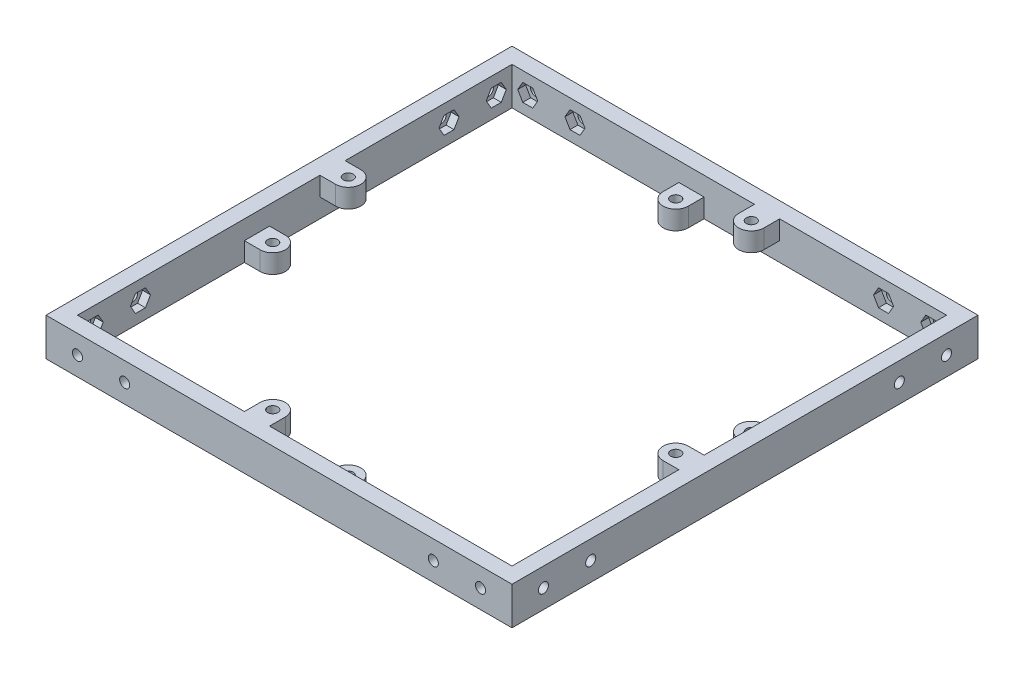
from build123d import *

# Parameters (mm, degrees)
SKETCH1_W           = 148
SKETCH1_H           = 148
SKETCH1_R           = 1.6
BOSS_EXTRUDE1_DEPTH = 6
SKETCH1_3_W         = 148
SKETCH1_3_H         = 148
SKETCH1_3_R         = 1.6
BOSS_EXTRUDE2_DEPTH = 6
CUT_EXTRUDE1_REACH  = 167.578
SKETCH2_R           = 1.6
CUT_EXTRUDE2_START  = -2.5
SKETCH2_3_R         = 1.6
CUT_EXTRUDE2_DEPTH  = 2.5
CIRPATTERN4_COUNT   = 4
CIRPATTERN6_COUNT   = 4


with BuildPart() as part:
    # Sketch1 → Boss-Extrude1 (new body)
    # profile 1 of 5: a face of its own
    with BuildSketch(Plane(origin=(0, 0, 0), x_dir=(1, 0, 0), z_dir=(0, 1, 0))):
        Rectangle(SKETCH1_W, SKETCH1_H)
        Polygon((16, -69), (69, -69), (69, -16), (69, -8), (69, 8), (69, 16), (69, 69), (16, 69), (8, 69), (-8, 69), (-16, 69), (-69, 69), (-69, 16), (-69, 8), (-69, -8), (-69, -16), (-69, -69), (-16, -69), (-8, -69), (8, -69), align=None, mode=Mode.SUBTRACT)
    # profile 2 of 5: a face of its own
    with BuildSketch(Plane(origin=(0, 0, 0), x_dir=(1, 0, 0), z_dir=(0, 1, 0))):
        with BuildLine():
            ThreePointArc((64, -16), (60, -12), (64, -8))
            Line((64, -8), (69, -8))
            Line((69, -8), (69, -16))
            Line((69, -16), (64, -16))
        make_face()
        with Locations(Location((64, -12, 0), (0, 0, 270))):
            Circle(SKETCH1_R, mode=Mode.SUBTRACT)
    # profile 3 of 5: a face of its own
    with BuildSketch(Plane(origin=(0, 0, 0), x_dir=(1, 0, 0), z_dir=(0, 1, 0))):
        with BuildLine():
            ThreePointArc((-16, -64), (-12, -60), (-8, -64))
            Line((-8, -64), (-8, -69))
            Line((-8, -69), (-16, -69))
            Line((-16, -69), (-16, -64))
        make_face()
        with Locations(Location((-12, -64, 0), (0, 0, 270))):
            Circle(SKETCH1_R, mode=Mode.SUBTRACT)
    # profile 4 of 5: a face of its own
    with BuildSketch(Plane(origin=(0, 0, 0), x_dir=(1, 0, 0), z_dir=(0, 1, 0))):
        with BuildLine():
            ThreePointArc((-64, 16), (-60, 12), (-64, 8))
            Line((-64, 8), (-69, 8))
            Line((-69, 8), (-69, 16))
            Line((-69, 16), (-64, 16))
        make_face()
        with Locations(Location((-64, 12, 0), (0, 0, 270))):
            Circle(SKETCH1_R, mode=Mode.SUBTRACT)
    # profile 5 of 5: a face of its own
    with BuildSketch(Plane(origin=(0, 0, 0), x_dir=(1, 0, 0), z_dir=(0, 1, 0))):
        with BuildLine():
            ThreePointArc((16, 64), (12, 60), (8, 64))
            Line((8, 64), (8, 69))
            Line((8, 69), (16, 69))
            Line((16, 69), (16, 64))
        make_face()
        with Locations(Location((12, 64, 0), (0, 0, 270))):
            Circle(SKETCH1_R, mode=Mode.SUBTRACT)
    extrude(amount=BOSS_EXTRUDE1_DEPTH)

    # Sketch1_3 → Boss-Extrude2 (add)
    # profile 1 of 5: a face of its own
    with BuildSketch(Plane(origin=(0, 0, 0), x_dir=(1, 0, 0), z_dir=(0, 1, 0))):
        Rectangle(SKETCH1_3_W, SKETCH1_3_H)
        Polygon((16, -69), (69, -69), (69, -16), (69, -8), (69, 8), (69, 16), (69, 69), (16, 69), (8, 69), (-8, 69), (-16, 69), (-69, 69), (-69, 16), (-69, 8), (-69, -8), (-69, -16), (-69, -69), (-16, -69), (-8, -69), (8, -69), align=None, mode=Mode.SUBTRACT)
    # profile 2 of 5: a face of its own
    with BuildSketch(Plane(origin=(0, 0, 0), x_dir=(1, 0, 0), z_dir=(0, 1, 0))):
        with BuildLine():
            ThreePointArc((8, -64), (12, -60), (16, -64))
            Line((16, -64), (16, -69))
            Line((16, -69), (8, -69))
            Line((8, -69), (8, -64))
        make_face()
        with Locations(Location((12, -64, 0), (0, 0, 270))):
            Circle(SKETCH1_3_R, mode=Mode.SUBTRACT)
    # profile 3 of 5: a face of its own
    with BuildSketch(Plane(origin=(0, 0, 0), x_dir=(1, 0, 0), z_dir=(0, 1, 0))):
        with BuildLine():
            ThreePointArc((-64, -8), (-60, -12), (-64, -16))
            Line((-64, -16), (-69, -16))
            Line((-69, -16), (-69, -8))
            Line((-69, -8), (-64, -8))
        make_face()
        with Locations(Location((-64, -12, 0), (0, 0, 270))):
            Circle(SKETCH1_3_R, mode=Mode.SUBTRACT)
    # profile 4 of 5: a face of its own
    with BuildSketch(Plane(origin=(0, 0, 0), x_dir=(1, 0, 0), z_dir=(0, 1, 0))):
        with BuildLine():
            ThreePointArc((-8, 64), (-12, 60), (-16, 64))
            Line((-16, 64), (-16, 69))
            Line((-16, 69), (-8, 69))
            Line((-8, 69), (-8, 64))
        make_face()
        with Locations(Location((-12, 64, 0), (0, 0, 270))):
            Circle(SKETCH1_3_R, mode=Mode.SUBTRACT)
    # profile 5 of 5: a face of its own
    with BuildSketch(Plane(origin=(0, 0, 0), x_dir=(1, 0, 0), z_dir=(0, 1, 0))):
        with BuildLine():
            ThreePointArc((64, 8), (60, 12), (64, 16))
            Line((64, 16), (69, 16))
            Line((69, 16), (69, 8))
            Line((69, 8), (64, 8))
        make_face()
        with Locations(Location((64, 12, 0), (0, 0, 270))):
            Circle(SKETCH1_3_R, mode=Mode.SUBTRACT)
    extrude(amount=-BOSS_EXTRUDE2_DEPTH)

    # Sketch2 → Cut-Extrude1 (cut, up to next)
    with BuildSketch(Plane(origin=(74, 0, 0), x_dir=(0, 0, -1), z_dir=(1, 0, 0)), mode=Mode.PRIVATE) as cut_extrude1_sk1:
        with Locations((-64, 0)):
            Circle(SKETCH2_R)
    cut_extrude1_tool1 = extrude(cut_extrude1_sk1.sketch, amount=-CUT_EXTRUDE1_REACH, mode=Mode.PRIVATE) & part.part
    # Sketch2 → Cut-Extrude1 (cut, up to next)
    with BuildSketch(Plane(origin=(74, 0, 0), x_dir=(0, 0, -1), z_dir=(1, 0, 0)), mode=Mode.PRIVATE) as cut_extrude1_sk2:
        with Locations((-49, 0)):
            Circle(SKETCH2_R)
    cut_extrude1_tool2 = extrude(cut_extrude1_sk2.sketch, amount=-CUT_EXTRUDE1_REACH, mode=Mode.PRIVATE) & part.part
    # Sketch2 → Cut-Extrude1 (cut, up to next)
    with BuildSketch(Plane(origin=(74, 0, 0), x_dir=(0, 0, -1), z_dir=(1, 0, 0)), mode=Mode.PRIVATE) as cut_extrude1_sk3:
        with Locations((49, 0)):
            Circle(SKETCH2_R)
    cut_extrude1_tool3 = extrude(cut_extrude1_sk3.sketch, amount=-CUT_EXTRUDE1_REACH, mode=Mode.PRIVATE) & part.part
    # Sketch2 → Cut-Extrude1 (cut, up to next)
    with BuildSketch(Plane(origin=(74, 0, 0), x_dir=(0, 0, -1), z_dir=(1, 0, 0)), mode=Mode.PRIVATE) as cut_extrude1_sk4:
        with Locations((64, 0)):
            Circle(SKETCH2_R)
    cut_extrude1_tool4 = extrude(cut_extrude1_sk4.sketch, amount=-CUT_EXTRUDE1_REACH, mode=Mode.PRIVATE) & part.part
    cut_extrude1_1 = cut_extrude1_tool1.solids().sort_by_distance((74, 0, 64))[0]
    add(cut_extrude1_1, mode=Mode.SUBTRACT)
    cut_extrude1_2 = cut_extrude1_tool2.solids().sort_by_distance((74, 0, 49))[0]
    add(cut_extrude1_2, mode=Mode.SUBTRACT)
    cut_extrude1_3 = cut_extrude1_tool3.solids().sort_by_distance((74, 0, -49))[0]
    add(cut_extrude1_3, mode=Mode.SUBTRACT)
    cut_extrude1_4 = cut_extrude1_tool4.solids().sort_by_distance((74, 0, -64))[0]
    add(cut_extrude1_4, mode=Mode.SUBTRACT)
    cut_extrude1 = cut_extrude1_1 + cut_extrude1_2 + cut_extrude1_3 + cut_extrude1_4  # Cut-Extrude1 as one shape, for the pattern or mirror that repeats it

    # Sketch2_3 → Cut-Extrude2 (cut)
    # profile 1 of 4: a face of its own
    with BuildSketch(Plane(origin=(74, 0, 0), x_dir=(0, 0, -1), z_dir=(1, 0, 0)).offset(CUT_EXTRUDE2_START)):
        Polygon((50.58771324, -2.75), (47.41228676, -2.75), (45.824573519, 0), (47.41228676, 2.75), (50.58771324, 2.75), (52.175426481, 0), align=None)
        with Locations((49, 0)):
            Circle(SKETCH2_3_R, mode=Mode.SUBTRACT)
    # profile 2 of 4: a face of its own
    with BuildSketch(Plane(origin=(74, 0, 0), x_dir=(0, 0, -1), z_dir=(1, 0, 0)).offset(CUT_EXTRUDE2_START)):
        Polygon((-62.41228676, -2.75), (-60.824573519, 0), (-62.41228676, 2.75), (-65.58771324, 2.75), (-67.175426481, 0), (-65.58771324, -2.75), align=None)
        with Locations((-64, 0)):
            Circle(SKETCH2_3_R, mode=Mode.SUBTRACT)
    # profile 3 of 4: a face of its own
    with BuildSketch(Plane(origin=(74, 0, 0), x_dir=(0, 0, -1), z_dir=(1, 0, 0)).offset(CUT_EXTRUDE2_START)):
        Polygon((-47.41228676, -2.75), (-45.824573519, 0), (-47.41228676, 2.75), (-50.58771324, 2.75), (-52.175426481, 0), (-50.58771324, -2.75), align=None)
        with Locations((-49, 0)):
            Circle(SKETCH2_3_R, mode=Mode.SUBTRACT)
    # profile 4 of 4: a face of its own
    with BuildSketch(Plane(origin=(74, 0, 0), x_dir=(0, 0, -1), z_dir=(1, 0, 0)).offset(CUT_EXTRUDE2_START)):
        Polygon((65.58771324, -2.75), (62.41228676, -2.75), (60.824573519, 0), (62.41228676, 2.75), (65.58771324, 2.75), (67.175426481, 0), align=None)
        with Locations((64, 0)):
            Circle(SKETCH2_3_R, mode=Mode.SUBTRACT)
    cut_extrude2 = extrude(amount=-CUT_EXTRUDE2_DEPTH, mode=Mode.SUBTRACT)

    # CirPattern4: Cut-Extrude1 ×4 about axis
    cirpattern4_axis = Axis((0, 49.55276796, 0), (0, -1, 0))
    for i in range(1, CIRPATTERN4_COUNT):
        add(cut_extrude1.rotate(cirpattern4_axis, i * 360 / CIRPATTERN4_COUNT), mode=Mode.SUBTRACT)

    # CirPattern6: Cut-Extrude2 ×4 about axis
    cirpattern6_axis = Axis((0, 0, 0), (0, 1, 0))
    for i in range(1, CIRPATTERN6_COUNT):
        add(cut_extrude2.rotate(cirpattern6_axis, i * 360 / CIRPATTERN6_COUNT), mode=Mode.SUBTRACT)


solid = part.part
